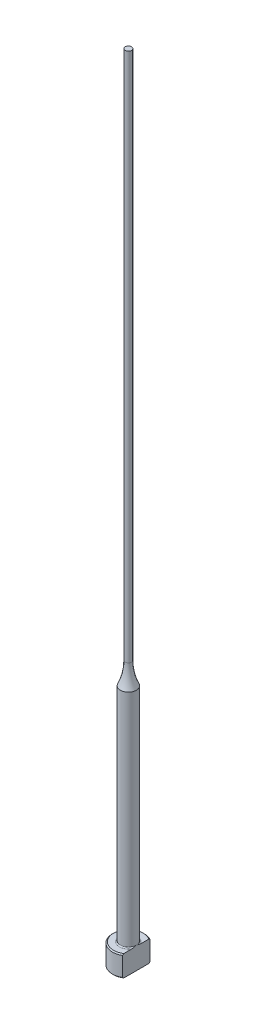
ISO-10303-21;
HEADER;
FILE_DESCRIPTION(('STEP AP214'),'2;1');
FILE_NAME('part.step','',(''),(''),'','','');
FILE_SCHEMA(('AUTOMOTIVE_DESIGN { 1 0 10303 214 1 1 1 1 }'));
ENDSEC;
DATA;
#1=APPLICATION_CONTEXT('core data for automotive mechanical design processes');
#2=APPLICATION_PROTOCOL_DEFINITION('international standard','automotive_design',2000,#1);
#3=PRODUCT_CONTEXT('',#1,'mechanical');
#4=PRODUCT('Part','Part','',(#3));
#5=PRODUCT_RELATED_PRODUCT_CATEGORY('part','',(#4));
#6=PRODUCT_DEFINITION_FORMATION('','',#4);
#7=PRODUCT_DEFINITION_CONTEXT('part definition',#1,'design');
#8=PRODUCT_DEFINITION('design','',#6,#7);
#9=PRODUCT_DEFINITION_SHAPE('','',#8);
#10=(LENGTH_UNIT() NAMED_UNIT(*) SI_UNIT(.MILLI.,.METRE.));
#11=(NAMED_UNIT(*) PLANE_ANGLE_UNIT() SI_UNIT($,.RADIAN.));
#12=(NAMED_UNIT(*) SI_UNIT($,.STERADIAN.) SOLID_ANGLE_UNIT());
#13=UNCERTAINTY_MEASURE_WITH_UNIT(LENGTH_MEASURE(1.E-05),#10,'distance_accuracy_value','');
#14=(GEOMETRIC_REPRESENTATION_CONTEXT(3) GLOBAL_UNCERTAINTY_ASSIGNED_CONTEXT((#13)) GLOBAL_UNIT_ASSIGNED_CONTEXT((#10,
#11,#12)) REPRESENTATION_CONTEXT('',''));
#15=CARTESIAN_POINT('',(0.,0.,0.));
#16=DIRECTION('',(0.,0.,1.));
#17=DIRECTION('',(1.,0.,0.));
#18=AXIS2_PLACEMENT_3D('',#15,#16,#17);
#19=CARTESIAN_POINT('',(-2.99999999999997,4.,0.));
#20=DIRECTION('',(0.,1.,0.));
#21=DIRECTION('',(0.,0.,1.));
#22=AXIS2_PLACEMENT_3D('',#19,#20,#21);
#23=PLANE('',#22);
#24=CARTESIAN_POINT('',(0.,4.,0.));
#25=DIRECTION('',(0.,1.,0.));
#26=DIRECTION('',(0.,0.,1.));
#27=AXIS2_PLACEMENT_3D('',#24,#25,#26);
#28=CIRCLE('',#27,2.79999999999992);
#29=CARTESIAN_POINT('',(1.49999999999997,4.,-2.3643180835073));
#30=VERTEX_POINT('',#29);
#31=CARTESIAN_POINT('',(1.49999999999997,4.,2.3643180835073));
#32=VERTEX_POINT('',#31);
#33=EDGE_CURVE('E187',#30,#32,#28,.T.);
#34=ORIENTED_EDGE('',*,*,#33,.T.);
#35=DIRECTION('',(0.,0.,-1.));
#36=VECTOR('',#35,1.);
#37=CARTESIAN_POINT('',(1.49999999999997,4.,0.));
#38=LINE('',#37,#36);
#39=CARTESIAN_POINT('',(1.49999999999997,3.99999999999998,0.799999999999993));
#40=VERTEX_POINT('',#39);
#41=EDGE_CURVE('E57',#32,#40,#38,.T.);
#42=ORIENTED_EDGE('',*,*,#41,.T.);
#43=CARTESIAN_POINT('',(0.,4.,0.));
#44=DIRECTION('',(0.,1.,0.));
#45=DIRECTION('',(0.,0.,1.));
#46=AXIS2_PLACEMENT_3D('',#43,#44,#45);
#47=CIRCLE('',#46,1.69999999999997);
#48=CARTESIAN_POINT('',(1.49999999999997,3.99999999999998,-0.799999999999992));
#49=VERTEX_POINT('',#48);
#50=EDGE_CURVE('E108',#40,#49,#47,.F.);
#51=ORIENTED_EDGE('',*,*,#50,.T.);
#52=EDGE_CURVE('E137',#49,#30,#38,.T.);
#53=ORIENTED_EDGE('',*,*,#52,.T.);
#54=EDGE_LOOP('',(#34,#42,#51,#53));
#55=FACE_BOUND('',#54,.T.);
#56=ADVANCED_FACE('F32',(#55),#23,.T.);
#57=CARTESIAN_POINT('',(0.,259.958771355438,0.));
#58=DIRECTION('',(0.,1.,0.));
#59=DIRECTION('',(0.,0.,1.));
#60=AXIS2_PLACEMENT_3D('',#57,#58,#59);
#61=CYLINDRICAL_SURFACE('',#60,2.99999999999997);
#62=CARTESIAN_POINT('',(0.,3.79999999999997,0.));
#63=DIRECTION('',(0.,1.,0.));
#64=DIRECTION('',(0.,0.,1.));
#65=AXIS2_PLACEMENT_3D('',#62,#63,#64);
#66=CIRCLE('',#65,2.99999999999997);
#67=CARTESIAN_POINT('',(1.49999999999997,3.79999999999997,2.5980762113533));
#68=VERTEX_POINT('',#67);
#69=CARTESIAN_POINT('',(1.49999999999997,3.79999999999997,-2.5980762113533));
#70=VERTEX_POINT('',#69);
#71=EDGE_CURVE('E105',#68,#70,#66,.F.);
#72=ORIENTED_EDGE('',*,*,#71,.T.);
#73=DIRECTION('',(0.,-1.,0.));
#74=VECTOR('',#73,1.);
#75=CARTESIAN_POINT('',(1.49999999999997,150.,-2.5980762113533));
#76=LINE('',#75,#74);
#77=CARTESIAN_POINT('',(1.49999999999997,0.199999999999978,-2.5980762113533));
#78=VERTEX_POINT('',#77);
#79=EDGE_CURVE('E193',#70,#78,#76,.T.);
#80=ORIENTED_EDGE('',*,*,#79,.T.);
#81=CARTESIAN_POINT('',(0.,0.199999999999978,0.));
#82=DIRECTION('',(0.,-1.,0.));
#83=DIRECTION('',(0.,0.,-1.));
#84=AXIS2_PLACEMENT_3D('',#81,#82,#83);
#85=CIRCLE('',#84,2.99999999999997);
#86=CARTESIAN_POINT('',(1.49999999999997,0.199999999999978,2.5980762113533));
#87=VERTEX_POINT('',#86);
#88=EDGE_CURVE('E100',#78,#87,#85,.F.);
#89=ORIENTED_EDGE('',*,*,#88,.T.);
#90=DIRECTION('',(0.,-1.,0.));
#91=VECTOR('',#90,1.);
#92=CARTESIAN_POINT('',(1.49999999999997,150.,2.5980762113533));
#93=LINE('',#92,#91);
#94=EDGE_CURVE('E93',#68,#87,#93,.T.);
#95=ORIENTED_EDGE('',*,*,#94,.F.);
#96=EDGE_LOOP('',(#72,#80,#89,#95));
#97=FACE_BOUND('',#96,.T.);
#98=ADVANCED_FACE('F158',(#97),#61,.T.);
#99=CARTESIAN_POINT('',(0.,0.,0.));
#100=DIRECTION('',(0.,-1.,0.));
#101=DIRECTION('',(0.,0.,-1.));
#102=AXIS2_PLACEMENT_3D('',#99,#100,#101);
#103=PLANE('',#102);
#104=CARTESIAN_POINT('',(0.,0.,0.));
#105=DIRECTION('',(0.,-1.,0.));
#106=DIRECTION('',(0.,0.,-1.));
#107=AXIS2_PLACEMENT_3D('',#104,#105,#106);
#108=CIRCLE('',#107,2.8);
#109=CARTESIAN_POINT('',(1.49999999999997,0.,2.36431808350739));
#110=VERTEX_POINT('',#109);
#111=CARTESIAN_POINT('',(1.49999999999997,0.,-2.36431808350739));
#112=VERTEX_POINT('',#111);
#113=EDGE_CURVE('E98',#110,#112,#108,.T.);
#114=ORIENTED_EDGE('',*,*,#113,.T.);
#115=DIRECTION('',(0.,0.,1.));
#116=VECTOR('',#115,1.);
#117=CARTESIAN_POINT('',(1.49999999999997,0.,2.5980762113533));
#118=LINE('',#117,#116);
#119=EDGE_CURVE('E83',#112,#110,#118,.T.);
#120=ORIENTED_EDGE('',*,*,#119,.T.);
#121=EDGE_LOOP('',(#114,#120));
#122=FACE_BOUND('',#121,.T.);
#123=ADVANCED_FACE('F103',(#122),#103,.T.);
#124=CARTESIAN_POINT('',(0.,4.,0.));
#125=DIRECTION('',(0.,-1.,0.));
#126=DIRECTION('',(0.,0.,-1.));
#127=AXIS2_PLACEMENT_3D('',#124,#125,#126);
#128=CONICAL_SURFACE('',#127,2.79999999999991,0.7853981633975);
#129=ORIENTED_EDGE('',*,*,#71,.F.);
#130=CARTESIAN_POINT('',(1.49999999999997,0.888258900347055,5.71827621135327));
#131=CARTESIAN_POINT('',(1.49999999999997,1.01361833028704,5.58866816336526));
#132=CARTESIAN_POINT('',(1.49999999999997,1.13884324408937,5.45892957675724));
#133=CARTESIAN_POINT('',(1.49999999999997,1.38894444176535,5.19911365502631));
#134=CARTESIAN_POINT('',(1.49999999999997,1.51382072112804,5.06903631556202));
#135=CARTESIAN_POINT('',(1.49999999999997,1.76320568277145,4.8084018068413));
#136=CARTESIAN_POINT('',(1.49999999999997,1.88771414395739,4.67784442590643));
#137=CARTESIAN_POINT('',(1.49999999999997,2.13618059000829,4.41620813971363));
#138=CARTESIAN_POINT('',(1.49999999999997,2.26013857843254,4.28512923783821));
#139=CARTESIAN_POINT('',(1.49999999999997,2.50488975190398,4.02490837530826));
#140=CARTESIAN_POINT('',(1.49999999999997,2.62569693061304,3.89577958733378));
#141=CARTESIAN_POINT('',(1.49999999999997,2.86640694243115,3.63668213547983));
#142=CARTESIAN_POINT('',(1.49999999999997,2.98630978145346,3.5067134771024));
#143=CARTESIAN_POINT('',(1.49999999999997,3.22486033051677,3.24567921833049));
#144=CARTESIAN_POINT('',(1.49999999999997,3.34350830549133,3.11461386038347));
#145=CARTESIAN_POINT('',(1.49999999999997,3.57907716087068,2.85094268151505));
#146=CARTESIAN_POINT('',(1.49999999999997,3.69599811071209,2.71833692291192));
#147=CARTESIAN_POINT('',(1.49999999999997,3.88262371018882,2.50255231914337));
#148=CARTESIAN_POINT('',(1.49999999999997,3.95312454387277,2.42006293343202));
#149=CARTESIAN_POINT('',(1.49999999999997,4.09287098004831,2.25401084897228));
#150=CARTESIAN_POINT('',(1.49999999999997,4.16211645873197,2.17044804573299));
#151=CARTESIAN_POINT('',(1.49999999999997,4.29964684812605,2.00105967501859));
#152=CARTESIAN_POINT('',(1.49999999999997,4.36791386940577,1.91521952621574));
#153=CARTESIAN_POINT('',(1.49999999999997,4.50205840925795,1.74171392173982));
#154=CARTESIAN_POINT('',(1.49999999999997,4.56793649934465,1.65404891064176));
#155=CARTESIAN_POINT('',(1.49999999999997,4.69728151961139,1.47490236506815));
#156=CARTESIAN_POINT('',(1.49999999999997,4.76069661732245,1.38338308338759));
#157=CARTESIAN_POINT('',(1.49999999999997,4.88239539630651,1.1967566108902));
#158=CARTESIAN_POINT('',(1.49999999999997,4.9406720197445,1.10164473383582));
#159=CARTESIAN_POINT('',(1.49999999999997,5.04841325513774,0.908008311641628));
#160=CARTESIAN_POINT('',(1.49999999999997,5.09797809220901,0.809540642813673));
#161=CARTESIAN_POINT('',(1.49999999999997,5.18432188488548,0.607192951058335));
#162=CARTESIAN_POINT('',(1.49999999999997,5.22114374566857,0.503332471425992));
#163=CARTESIAN_POINT('',(1.49999999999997,5.26099935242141,0.347577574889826));
#164=CARTESIAN_POINT('',(1.49999999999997,5.27157029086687,0.297609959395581));
#165=CARTESIAN_POINT('',(1.49999999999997,5.28794860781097,0.196885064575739));
#166=CARTESIAN_POINT('',(1.49999999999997,5.29375640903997,0.146127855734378));
#167=CARTESIAN_POINT('',(1.49999999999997,5.3001970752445,0.0444388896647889));
#168=CARTESIAN_POINT('',(1.49999999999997,5.3008459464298,-0.00649183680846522));
#169=CARTESIAN_POINT('',(1.49999999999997,5.29696416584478,-0.108155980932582));
#170=CARTESIAN_POINT('',(1.49999999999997,5.29243308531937,-0.158889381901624));
#171=CARTESIAN_POINT('',(1.49999999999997,5.2785691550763,-0.259234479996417));
#172=CARTESIAN_POINT('',(1.49999999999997,5.2692782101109,-0.308852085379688));
#173=CARTESIAN_POINT('',(1.49999999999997,5.24647108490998,-0.40711049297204));
#174=CARTESIAN_POINT('',(1.49999999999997,5.23295324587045,-0.455750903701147));
#175=CARTESIAN_POINT('',(1.49999999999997,5.20226175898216,-0.552149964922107));
#176=CARTESIAN_POINT('',(1.49999999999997,5.18506801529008,-0.5999021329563));
#177=CARTESIAN_POINT('',(1.49999999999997,5.14771387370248,-0.694205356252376));
#178=CARTESIAN_POINT('',(1.49999999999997,5.12755408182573,-0.740756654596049));
#179=CARTESIAN_POINT('',(1.49999999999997,5.06327696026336,-0.879166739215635));
#180=CARTESIAN_POINT('',(1.49999999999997,5.01551721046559,-0.969329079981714));
#181=CARTESIAN_POINT('',(1.49999999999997,4.91367909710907,-1.1460431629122));
#182=CARTESIAN_POINT('',(1.49999999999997,4.85959300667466,-1.23259031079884));
#183=CARTESIAN_POINT('',(1.49999999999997,4.74697968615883,-1.40321348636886));
#184=CARTESIAN_POINT('',(1.49999999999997,4.68843573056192,-1.48727838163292));
#185=CARTESIAN_POINT('',(1.49999999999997,4.56843845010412,-1.6532218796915));
#186=CARTESIAN_POINT('',(1.49999999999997,4.50698656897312,-1.73510153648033));
#187=CARTESIAN_POINT('',(1.49999999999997,4.38115673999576,-1.89829823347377));
#188=CARTESIAN_POINT('',(1.49999999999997,4.31675092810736,-1.9795936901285));
#189=CARTESIAN_POINT('',(1.49999999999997,4.18634068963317,-2.14090082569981));
#190=CARTESIAN_POINT('',(1.49999999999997,4.12033609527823,-2.22091236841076));
#191=CARTESIAN_POINT('',(1.49999999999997,3.92086431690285,-2.45906508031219));
#192=CARTESIAN_POINT('',(1.49999999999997,3.78562663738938,-2.61572090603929));
#193=CARTESIAN_POINT('',(1.49999999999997,3.53554498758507,-2.90006295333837));
#194=CARTESIAN_POINT('',(1.49999999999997,3.42114543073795,-3.02814382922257));
#195=CARTESIAN_POINT('',(1.49999999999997,3.19093557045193,-3.28303767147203));
#196=CARTESIAN_POINT('',(1.49999999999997,3.07512522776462,-3.40985060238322));
#197=CARTESIAN_POINT('',(1.49999999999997,2.72597067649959,-3.78913849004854));
#198=CARTESIAN_POINT('',(1.49999999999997,2.49111760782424,-4.04022177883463));
#199=CARTESIAN_POINT('',(1.49999999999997,2.02882478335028,-4.52992803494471));
#200=CARTESIAN_POINT('',(1.49999999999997,1.80147747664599,-4.76863870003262));
#201=CARTESIAN_POINT('',(1.49999999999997,1.45954865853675,-5.12558036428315));
#202=CARTESIAN_POINT('',(1.49999999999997,1.34548484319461,-5.24430773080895));
#203=CARTESIAN_POINT('',(1.49999999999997,1.11707176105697,-5.48148573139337));
#204=CARTESIAN_POINT('',(1.49999999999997,1.00272249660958,-5.59993636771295));
#205=CARTESIAN_POINT('',(1.49999999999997,0.888258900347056,-5.71827621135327));
#206=B_SPLINE_CURVE_WITH_KNOTS('',3,(#130,#131,#132,#133,#134,#135,#136,#137,#138,#139,#140,
#141,#142,#143,#144,#145,#146,#147,#148,#149,#150,#151,#152,#153,#154,#155,#156,#157,#158,#159,
#160,#161,#162,#163,#164,#165,#166,#167,#168,#169,#170,#171,#172,#173,#174,#175,#176,#177,#178,
#179,#180,#181,#182,#183,#184,#185,#186,#187,#188,#189,#190,#191,#192,#193,#194,#195,#196,#197,
#198,#199,#200,#201,#202,#203,#204,#205),.UNSPECIFIED.,.F.,.F.,(4,2,2,2,2,2,2,2,2,2,2,2,2,2,2,2,
2,2,2,2,2,2,2,2,2,2,2,2,2,2,2,2,2,2,2,2,2,4),(0.,0.540943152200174,1.08189327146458,
1.62312052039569,2.16434426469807,2.69482920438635,3.22531067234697,3.75567781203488,
4.28602356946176,4.61155053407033,4.93710943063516,5.26610945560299,5.59503024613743,
5.92894782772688,6.26331713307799,6.59354403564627,6.92264800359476,7.07567478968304,
7.22868799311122,7.38122626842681,7.53377717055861,7.68500755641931,7.83629736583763,
7.98843643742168,8.14054446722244,8.4461879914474,8.75220879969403,9.05944044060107,
9.366521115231,9.677642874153,9.98879742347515,10.6095925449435,11.1247803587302,
11.6399825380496,12.6713544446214,13.6603005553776,14.1542238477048,14.648143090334),.UNSPECIFIED.);
#207=EDGE_CURVE('E136',#68,#32,#206,.T.);
#208=ORIENTED_EDGE('',*,*,#207,.T.);
#209=ORIENTED_EDGE('',*,*,#33,.F.);
#210=EDGE_CURVE('E128',#30,#70,#206,.T.);
#211=ORIENTED_EDGE('',*,*,#210,.T.);
#212=EDGE_LOOP('',(#129,#208,#209,#211));
#213=FACE_BOUND('',#212,.T.);
#214=ADVANCED_FACE('F144',(#213),#128,.T.);
#215=CARTESIAN_POINT('',(0.,0.199999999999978,0.));
#216=DIRECTION('',(0.,1.,0.));
#217=DIRECTION('',(0.,0.,1.));
#218=AXIS2_PLACEMENT_3D('',#215,#216,#217);
#219=CONICAL_SURFACE('',#218,2.99999999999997,0.785398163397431);
#220=ORIENTED_EDGE('',*,*,#88,.F.);
#221=CARTESIAN_POINT('',(1.49999999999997,3.1117410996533,-5.71827621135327));
#222=CARTESIAN_POINT('',(1.49999999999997,2.98638166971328,-5.58866816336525));
#223=CARTESIAN_POINT('',(1.49999999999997,2.86115675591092,-5.45892957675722));
#224=CARTESIAN_POINT('',(1.49999999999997,2.61105555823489,-5.19911365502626));
#225=CARTESIAN_POINT('',(1.49999999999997,2.48617927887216,-5.06903631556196));
#226=CARTESIAN_POINT('',(1.49999999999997,2.23679431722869,-4.80840180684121));
#227=CARTESIAN_POINT('',(1.49999999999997,2.11228585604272,-4.67784442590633));
#228=CARTESIAN_POINT('',(1.49999999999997,1.86381940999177,-4.4162081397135));
#229=CARTESIAN_POINT('',(1.49999999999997,1.73986142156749,-4.28512923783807));
#230=CARTESIAN_POINT('',(1.49999999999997,1.49511024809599,-4.02490837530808));
#231=CARTESIAN_POINT('',(1.49999999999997,1.3743030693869,-3.8957795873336));
#232=CARTESIAN_POINT('',(1.49999999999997,1.13359305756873,-3.63668213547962));
#233=CARTESIAN_POINT('',(1.49999999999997,1.0136902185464,-3.50671347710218));
#234=CARTESIAN_POINT('',(1.49999999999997,0.77513966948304,-3.24567921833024));
#235=CARTESIAN_POINT('',(1.49999999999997,0.656491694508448,-3.11461386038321));
#236=CARTESIAN_POINT('',(1.49999999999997,0.420922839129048,-2.85094268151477));
#237=CARTESIAN_POINT('',(1.49999999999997,0.30400188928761,-2.71833692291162));
#238=CARTESIAN_POINT('',(1.49999999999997,0.11737628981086,-2.50255231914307));
#239=CARTESIAN_POINT('',(1.49999999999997,0.046875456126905,-2.42006293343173));
#240=CARTESIAN_POINT('',(1.49999999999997,-0.0928709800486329,-2.254010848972));
#241=CARTESIAN_POINT('',(1.49999999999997,-0.162116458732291,-2.17044804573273));
#242=CARTESIAN_POINT('',(1.49999999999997,-0.299646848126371,-2.00105967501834));
#243=CARTESIAN_POINT('',(1.49999999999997,-0.367913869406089,-1.9152195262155));
#244=CARTESIAN_POINT('',(1.49999999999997,-0.502058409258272,-1.7417139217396));
#245=CARTESIAN_POINT('',(1.49999999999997,-0.567936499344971,-1.65404891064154));
#246=CARTESIAN_POINT('',(1.49999999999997,-0.697281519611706,-1.47490236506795));
#247=CARTESIAN_POINT('',(1.49999999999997,-0.76069661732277,-1.38338308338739));
#248=CARTESIAN_POINT('',(1.49999999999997,-0.882395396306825,-1.19675661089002));
#249=CARTESIAN_POINT('',(1.49999999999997,-0.940672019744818,-1.10164473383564));
#250=CARTESIAN_POINT('',(1.49999999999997,-1.04841325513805,-0.908008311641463));
#251=CARTESIAN_POINT('',(1.49999999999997,-1.09797809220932,-0.809540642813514));
#252=CARTESIAN_POINT('',(1.49999999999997,-1.18432188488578,-0.607192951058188));
#253=CARTESIAN_POINT('',(1.49999999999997,-1.22114374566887,-0.50333247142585));
#254=CARTESIAN_POINT('',(1.49999999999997,-1.26099935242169,-0.347577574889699));
#255=CARTESIAN_POINT('',(1.49999999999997,-1.27157029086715,-0.297609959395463));
#256=CARTESIAN_POINT('',(1.49999999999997,-1.28794860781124,-0.196885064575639));
#257=CARTESIAN_POINT('',(1.49999999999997,-1.29375640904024,-0.146127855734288));
#258=CARTESIAN_POINT('',(1.49999999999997,-1.30019707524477,-0.0444388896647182));
#259=CARTESIAN_POINT('',(1.49999999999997,-1.30084594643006,0.00649183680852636));
#260=CARTESIAN_POINT('',(1.49999999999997,-1.29696416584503,0.108155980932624));
#261=CARTESIAN_POINT('',(1.49999999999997,-1.29243308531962,0.158889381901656));
#262=CARTESIAN_POINT('',(1.49999999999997,-1.27856915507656,0.25923447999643));
#263=CARTESIAN_POINT('',(1.49999999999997,-1.26927821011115,0.308852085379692));
#264=CARTESIAN_POINT('',(1.49999999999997,-1.24647108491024,0.407110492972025));
#265=CARTESIAN_POINT('',(1.49999999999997,-1.2329532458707,0.455750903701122));
#266=CARTESIAN_POINT('',(1.49999999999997,-1.20226175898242,0.552149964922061));
#267=CARTESIAN_POINT('',(1.49999999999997,-1.18506801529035,0.599902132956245));
#268=CARTESIAN_POINT('',(1.49999999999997,-1.14771387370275,0.694205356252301));
#269=CARTESIAN_POINT('',(1.49999999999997,-1.12755408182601,0.740756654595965));
#270=CARTESIAN_POINT('',(1.49999999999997,-1.06327696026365,0.879166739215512));
#271=CARTESIAN_POINT('',(1.49999999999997,-1.0155172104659,0.969329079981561));
#272=CARTESIAN_POINT('',(1.49999999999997,-0.913679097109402,1.14604316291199));
#273=CARTESIAN_POINT('',(1.49999999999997,-0.859593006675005,1.2325903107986));
#274=CARTESIAN_POINT('',(1.49999999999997,-0.746979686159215,1.40321348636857));
#275=CARTESIAN_POINT('',(1.49999999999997,-0.688435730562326,1.4872783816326));
#276=CARTESIAN_POINT('',(1.49999999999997,-0.568438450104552,1.65322187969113));
#277=CARTESIAN_POINT('',(1.49999999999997,-0.506986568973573,1.73510153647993));
#278=CARTESIAN_POINT('',(1.49999999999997,-0.381156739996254,1.89829823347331));
#279=CARTESIAN_POINT('',(1.49999999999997,-0.316750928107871,1.97959369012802));
#280=CARTESIAN_POINT('',(1.49999999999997,-0.18634068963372,2.14090082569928));
#281=CARTESIAN_POINT('',(1.49999999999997,-0.120336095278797,2.22091236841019));
#282=CARTESIAN_POINT('',(1.49999999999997,0.0791356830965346,2.45906508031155));
#283=CARTESIAN_POINT('',(1.49999999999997,0.214373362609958,2.61572090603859));
#284=CARTESIAN_POINT('',(1.49999999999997,0.464455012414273,2.90006295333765));
#285=CARTESIAN_POINT('',(1.49999999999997,0.578854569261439,3.02814382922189));
#286=CARTESIAN_POINT('',(1.49999999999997,0.809064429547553,3.28303767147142));
#287=CARTESIAN_POINT('',(1.49999999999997,0.924874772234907,3.40985060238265));
#288=CARTESIAN_POINT('',(1.49999999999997,1.27402932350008,3.78913849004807));
#289=CARTESIAN_POINT('',(1.49999999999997,1.50888239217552,4.04022177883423));
#290=CARTESIAN_POINT('',(1.49999999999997,1.97117521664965,4.52992803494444));
#291=CARTESIAN_POINT('',(1.49999999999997,2.19852252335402,4.76863870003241));
#292=CARTESIAN_POINT('',(1.49999999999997,2.54045134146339,5.12558036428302));
#293=CARTESIAN_POINT('',(1.49999999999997,2.65451515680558,5.24430773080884));
#294=CARTESIAN_POINT('',(1.49999999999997,2.8829282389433,5.48148573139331));
#295=CARTESIAN_POINT('',(1.49999999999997,2.99727750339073,5.59993636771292));
#296=CARTESIAN_POINT('',(1.49999999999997,3.1117410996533,5.71827621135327));
#297=B_SPLINE_CURVE_WITH_KNOTS('',3,(#221,#222,#223,#224,#225,#226,#227,#228,#229,#230,#231,
#232,#233,#234,#235,#236,#237,#238,#239,#240,#241,#242,#243,#244,#245,#246,#247,#248,#249,#250,
#251,#252,#253,#254,#255,#256,#257,#258,#259,#260,#261,#262,#263,#264,#265,#266,#267,#268,#269,
#270,#271,#272,#273,#274,#275,#276,#277,#278,#279,#280,#281,#282,#283,#284,#285,#286,#287,#288,
#289,#290,#291,#292,#293,#294,#295,#296),.UNSPECIFIED.,.F.,.F.,(4,2,2,2,2,2,2,2,2,2,2,2,2,2,2,2,
2,2,2,2,2,2,2,2,2,2,2,2,2,2,2,2,2,2,2,2,2,4),(0.,0.540943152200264,1.08189327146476,
1.62312052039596,2.16434426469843,2.69482920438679,3.22531067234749,3.75567781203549,
4.28602356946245,4.611550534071,4.9371094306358,5.26610945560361,5.59503024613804,
5.92894782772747,6.26331713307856,6.59354403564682,6.92264800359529,7.07567478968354,
7.22868799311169,7.38122626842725,7.53377717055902,7.6850075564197,7.83629736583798,
7.98843643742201,8.14054446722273,8.44618799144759,8.75220879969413,9.05944044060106,
9.3665211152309,9.6776428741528,9.98879742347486,10.609592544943,11.1247803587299,
11.6399825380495,12.6713544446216,13.6603005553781,14.1542238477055,14.6481430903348),.UNSPECIFIED.);
#298=EDGE_CURVE('E86',#78,#112,#297,.T.);
#299=ORIENTED_EDGE('',*,*,#298,.T.);
#300=ORIENTED_EDGE('',*,*,#113,.F.);
#301=EDGE_CURVE('E89',#110,#87,#297,.T.);
#302=ORIENTED_EDGE('',*,*,#301,.T.);
#303=EDGE_LOOP('',(#220,#299,#300,#302));
#304=FACE_BOUND('',#303,.T.);
#305=ADVANCED_FACE('F97',(#304),#219,.T.);
#306=CARTESIAN_POINT('',(0.,4.19999999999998,0.));
#307=DIRECTION('',(0.,1.,0.));
#308=DIRECTION('',(0.,0.,1.));
#309=AXIS2_PLACEMENT_3D('',#306,#307,#308);
#310=TOROIDAL_SURFACE('',#309,1.69999999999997,0.2);
#311=CARTESIAN_POINT('',(1.49999999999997,4.19999999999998,0.));
#312=CARTESIAN_POINT('',(1.49999999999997,4.20000050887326,7.14686674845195E-11));
#313=CARTESIAN_POINT('',(1.49999999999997,4.20000101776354,-1.21663673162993E-07));
#314=CARTESIAN_POINT('',(1.49999999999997,4.20000199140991,-4.97616237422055E-07));
#315=CARTESIAN_POINT('',(1.49999999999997,4.20000245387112,-7.56516220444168E-07));
#316=CARTESIAN_POINT('',(1.49999999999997,4.20000338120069,-1.37642837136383E-06));
#317=CARTESIAN_POINT('',(1.49999999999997,4.20000384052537,-1.74563476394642E-06));
#318=CARTESIAN_POINT('',(1.49999999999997,4.20000469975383,-2.53565984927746E-06));
#319=CARTESIAN_POINT('',(1.49999999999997,4.20000510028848,-2.95582597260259E-06));
#320=CARTESIAN_POINT('',(1.49999999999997,4.20000646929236,-4.48430445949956E-06));
#321=CARTESIAN_POINT('',(1.49999999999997,4.20000736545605,-5.6586103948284E-06));
#322=CARTESIAN_POINT('',(1.49999999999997,4.20000893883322,-8.06479202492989E-06));
#323=CARTESIAN_POINT('',(1.49999999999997,4.20000962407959,-9.29170517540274E-06));
#324=CARTESIAN_POINT('',(1.49999999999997,4.20001225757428,-1.416232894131E-05));
#325=CARTESIAN_POINT('',(1.49999999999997,4.20001407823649,-1.78790031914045E-05));
#326=CARTESIAN_POINT('',(1.49999999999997,4.20001699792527,-2.51443066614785E-05));
#327=CARTESIAN_POINT('',(1.49999999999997,4.20001815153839,-2.86715394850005E-05));
#328=CARTESIAN_POINT('',(1.49999999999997,4.20002315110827,-4.39218128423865E-05));
#329=CARTESIAN_POINT('',(1.49999999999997,4.20002701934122,-5.56288390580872E-05));
#330=CARTESIAN_POINT('',(1.49999999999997,4.20003312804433,-7.7405829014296E-05));
#331=CARTESIAN_POINT('',(1.49999999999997,4.20003553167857,-8.74278412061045E-05));
#332=CARTESIAN_POINT('',(1.49999999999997,4.20005483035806,-0.000161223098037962));
#333=CARTESIAN_POINT('',(1.49999999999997,4.20007979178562,-0.000222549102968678));
#334=CARTESIAN_POINT('',(1.49999999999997,4.20017391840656,-0.000462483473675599));
#335=CARTESIAN_POINT('',(1.49999999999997,4.20023706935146,-0.000642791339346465));
#336=CARTESIAN_POINT('',(1.49999999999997,4.20048761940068,-0.00134785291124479));
#337=CARTESIAN_POINT('',(1.49999999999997,4.20068132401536,-0.00187087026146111));
#338=CARTESIAN_POINT('',(1.49999999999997,4.20147357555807,-0.00402004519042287));
#339=CARTESIAN_POINT('',(1.49999999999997,4.20206499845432,-0.0056481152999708));
#340=CARTESIAN_POINT('',(1.49999999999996,4.20892634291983,-0.0245232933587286));
#341=CARTESIAN_POINT('',(1.49999999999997,4.21523683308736,-0.041759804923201));
#342=CARTESIAN_POINT('',(1.49999999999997,4.22755028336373,-0.0756091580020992));
#343=CARTESIAN_POINT('',(1.49999999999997,4.23355589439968,-0.0922211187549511));
#344=CARTESIAN_POINT('',(1.49999999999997,4.24620101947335,-0.127454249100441));
#345=CARTESIAN_POINT('',(1.49999999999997,4.25283080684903,-0.146078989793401));
#346=CARTESIAN_POINT('',(1.49999999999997,4.26599765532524,-0.183577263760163));
#347=CARTESIAN_POINT('',(1.49999999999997,4.27253305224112,-0.202451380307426));
#348=CARTESIAN_POINT('',(1.49999999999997,4.28834228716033,-0.248982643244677));
#349=CARTESIAN_POINT('',(1.49999999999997,4.2974915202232,-0.276682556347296));
#350=CARTESIAN_POINT('',(1.49999999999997,4.31490935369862,-0.331625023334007));
#351=CARTESIAN_POINT('',(1.49999999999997,4.3231938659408,-0.358862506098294));
#352=CARTESIAN_POINT('',(1.49999999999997,4.34051594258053,-0.419125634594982));
#353=CARTESIAN_POINT('',(1.49999999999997,4.34936607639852,-0.452206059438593));
#354=CARTESIAN_POINT('',(1.49999999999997,4.36549583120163,-0.519023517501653));
#355=CARTESIAN_POINT('',(1.49999999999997,4.37276283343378,-0.552763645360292));
#356=CARTESIAN_POINT('',(1.49999999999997,4.38554755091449,-0.62305310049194));
#357=CARTESIAN_POINT('',(1.49999999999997,4.39090573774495,-0.65963271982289));
#358=CARTESIAN_POINT('',(1.49999999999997,4.39825016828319,-0.733028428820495));
#359=CARTESIAN_POINT('',(1.49999999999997,4.40024734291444,-0.76984335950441));
#360=CARTESIAN_POINT('',(1.49999999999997,4.39970780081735,-0.842856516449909));
#361=CARTESIAN_POINT('',(1.49999999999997,4.39725347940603,-0.879053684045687));
#362=CARTESIAN_POINT('',(1.49999999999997,4.38900085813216,-0.93238076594));
#363=CARTESIAN_POINT('',(1.49999999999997,4.38553049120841,-0.949868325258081));
#364=CARTESIAN_POINT('',(1.49999999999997,4.37678336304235,-0.984374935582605));
#365=CARTESIAN_POINT('',(1.49999999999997,4.37150943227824,-1.00139467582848));
#366=CARTESIAN_POINT('',(1.49999999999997,4.35869781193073,-1.03479423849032));
#367=CARTESIAN_POINT('',(1.49999999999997,4.3511359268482,-1.05116499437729));
#368=CARTESIAN_POINT('',(1.49999999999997,4.33325333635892,-1.08234828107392));
#369=CARTESIAN_POINT('',(1.49999999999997,4.32294266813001,-1.09716621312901));
#370=CARTESIAN_POINT('',(1.49999999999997,4.30512758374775,-1.11714173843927));
#371=CARTESIAN_POINT('',(1.49999999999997,4.29884721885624,-1.12339066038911));
#372=CARTESIAN_POINT('',(1.49999999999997,4.28545950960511,-1.13494695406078));
#373=CARTESIAN_POINT('',(1.49999999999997,4.27835226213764,-1.14025443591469));
#374=CARTESIAN_POINT('',(1.49999999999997,4.26325970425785,-1.14967631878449));
#375=CARTESIAN_POINT('',(1.49999999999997,4.25526534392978,-1.15377649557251));
#376=CARTESIAN_POINT('',(1.49999999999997,4.23863207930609,-1.16034952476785));
#377=CARTESIAN_POINT('',(1.49999999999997,4.22999427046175,-1.16282507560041));
#378=CARTESIAN_POINT('',(1.49999999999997,4.21343922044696,-1.16570267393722));
#379=CARTESIAN_POINT('',(1.49999999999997,4.20555896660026,-1.16631687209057));
#380=CARTESIAN_POINT('',(1.49999999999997,4.18982775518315,-1.16602054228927));
#381=CARTESIAN_POINT('',(1.49999999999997,4.18197679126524,-1.16511036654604));
#382=CARTESIAN_POINT('',(1.49999999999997,4.16747846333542,-1.16204446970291));
#383=CARTESIAN_POINT('',(1.49999999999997,4.16079696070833,-1.16004509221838));
#384=CARTESIAN_POINT('',(1.49999999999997,4.14781700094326,-1.15505972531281));
#385=CARTESIAN_POINT('',(1.49999999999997,4.14151862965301,-1.1520735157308));
#386=CARTESIAN_POINT('',(1.49999999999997,4.12690214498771,-1.14387585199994));
#387=CARTESIAN_POINT('',(1.49999999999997,4.11881436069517,-1.13825400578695));
#388=CARTESIAN_POINT('',(1.49999999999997,4.1036444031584,-1.12578441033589));
#389=CARTESIAN_POINT('',(1.49999999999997,4.09656475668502,-1.11893367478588));
#390=CARTESIAN_POINT('',(1.49999999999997,4.08012297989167,-1.10074342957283));
#391=CARTESIAN_POINT('',(1.49999999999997,4.07136543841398,-1.08886044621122));
#392=CARTESIAN_POINT('',(1.49999999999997,4.05578194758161,-1.06392743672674));
#393=CARTESIAN_POINT('',(1.49999999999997,4.0489571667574,-1.05087671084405));
#394=CARTESIAN_POINT('',(1.49999999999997,4.03273856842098,-1.01472307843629));
#395=CARTESIAN_POINT('',(1.49999999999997,4.02486230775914,-0.990945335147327));
#396=CARTESIAN_POINT('',(1.49999999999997,4.01257693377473,-0.94232199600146));
#397=CARTESIAN_POINT('',(1.49999999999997,4.00820590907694,-0.917467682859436));
#398=CARTESIAN_POINT('',(1.49999999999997,4.00229956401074,-0.867912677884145));
#399=CARTESIAN_POINT('',(1.49999999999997,4.0007128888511,-0.843217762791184));
#400=CARTESIAN_POINT('',(1.49999999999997,3.9996723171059,-0.79374605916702));
#401=CARTESIAN_POINT('',(1.49999999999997,4.0002230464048,-0.768969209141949));
#402=CARTESIAN_POINT('',(1.49999999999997,4.00433101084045,-0.696994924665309));
#403=CARTESIAN_POINT('',(1.49999999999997,4.01016976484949,-0.64993124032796));
#404=CARTESIAN_POINT('',(1.49999999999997,4.02567776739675,-0.559166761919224));
#405=CARTESIAN_POINT('',(1.49999999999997,4.03511950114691,-0.515423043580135));
#406=CARTESIAN_POINT('',(1.49999999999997,4.05693059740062,-0.427590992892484));
#407=CARTESIAN_POINT('',(1.49999999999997,4.06936356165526,-0.383518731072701));
#408=CARTESIAN_POINT('',(1.49999999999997,4.09174953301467,-0.310161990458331));
#409=CARTESIAN_POINT('',(1.49999999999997,4.10119843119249,-0.280718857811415));
#410=CARTESIAN_POINT('',(1.49999999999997,4.12060442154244,-0.22234098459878));
#411=CARTESIAN_POINT('',(1.49999999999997,4.13055519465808,-0.193404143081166));
#412=CARTESIAN_POINT('',(1.49999999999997,4.14973721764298,-0.138756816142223));
#413=CARTESIAN_POINT('',(1.49999999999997,4.15893123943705,-0.113033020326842));
#414=CARTESIAN_POINT('',(1.49999999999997,4.17788037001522,-0.0606351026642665));
#415=CARTESIAN_POINT('',(1.49999999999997,4.18764328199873,-0.0339636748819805));
#416=CARTESIAN_POINT('',(1.49999999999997,4.19793548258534,-0.00564657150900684));
#417=CARTESIAN_POINT('',(1.49999999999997,4.19852751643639,-0.00401699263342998));
#418=CARTESIAN_POINT('',(1.49999999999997,4.1993199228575,-0.0018674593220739));
#419=CARTESIAN_POINT('',(1.49999999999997,4.19951319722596,-0.00134559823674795));
#420=CARTESIAN_POINT('',(1.49999999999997,4.19976322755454,-0.000641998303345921));
#421=CARTESIAN_POINT('',(1.49999999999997,4.19982627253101,-0.000461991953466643));
#422=CARTESIAN_POINT('',(1.49999999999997,4.19992025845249,-0.000222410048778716));
#423=CARTESIAN_POINT('',(1.49999999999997,4.19994519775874,-0.000161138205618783));
#424=CARTESIAN_POINT('',(1.49999999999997,4.19996448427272,-8.74039267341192E-05));
#425=CARTESIAN_POINT('',(1.49999999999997,4.19996688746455,-7.73857556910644E-05));
#426=CARTESIAN_POINT('',(1.49999999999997,4.1999729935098,-5.56173272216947E-05));
#427=CARTESIAN_POINT('',(1.49999999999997,4.19997685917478,-4.39149186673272E-05));
#428=CARTESIAN_POINT('',(1.49999999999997,4.19998185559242,-2.86698156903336E-05));
#429=CARTESIAN_POINT('',(1.49999999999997,4.19998300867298,-2.51431575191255E-05));
#430=CARTESIAN_POINT('',(1.49999999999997,4.19998592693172,-1.78789552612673E-05));
#431=CARTESIAN_POINT('',(1.49999999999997,4.19998774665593,-1.41627846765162E-05));
#432=CARTESIAN_POINT('',(1.49999999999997,4.19999037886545,-9.29264488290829E-06));
#433=CARTESIAN_POINT('',(1.49999999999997,4.19999106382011,-8.06577599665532E-06));
#434=CARTESIAN_POINT('',(1.49999999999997,4.19999263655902,-5.65962639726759E-06));
#435=CARTESIAN_POINT('',(1.49999999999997,4.19999353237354,-4.48530466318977E-06));
#436=CARTESIAN_POINT('',(1.49999999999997,4.19999490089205,-2.95673740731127E-06));
#437=CARTESIAN_POINT('',(1.49999999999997,4.1999953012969,-2.53653208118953E-06));
#438=CARTESIAN_POINT('',(1.49999999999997,4.19999616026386,-1.74640525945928E-06));
#439=CARTESIAN_POINT('',(1.49999999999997,4.19999661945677,-1.37713598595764E-06));
#440=CARTESIAN_POINT('',(1.49999999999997,4.19999754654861,-7.57072336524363E-07));
#441=CARTESIAN_POINT('',(1.49999999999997,4.19999800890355,-4.9808738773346E-07));
#442=CARTESIAN_POINT('',(1.49999999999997,4.19999898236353,-1.21927249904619E-07));
#443=CARTESIAN_POINT('',(1.49999999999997,4.19999949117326,-7.14621294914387E-11));
#444=CARTESIAN_POINT('',(1.49999999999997,4.19999999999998,0.));
#445=B_SPLINE_CURVE_WITH_KNOTS('',3,(#311,#312,#313,#314,#315,#316,#317,#318,#319,#320,#321,
#322,#323,#324,#325,#326,#327,#328,#329,#330,#331,#332,#333,#334,#335,#336,#337,#338,#339,#340,
#341,#342,#343,#344,#345,#346,#347,#348,#349,#350,#351,#352,#353,#354,#355,#356,#357,#358,#359,
#360,#361,#362,#363,#364,#365,#366,#367,#368,#369,#370,#371,#372,#373,#374,#375,#376,#377,#378,
#379,#380,#381,#382,#383,#384,#385,#386,#387,#388,#389,#390,#391,#392,#393,#394,#395,#396,#397,
#398,#399,#400,#401,#402,#403,#404,#405,#406,#407,#408,#409,#410,#411,#412,#413,#414,#415,#416,
#417,#418,#419,#420,#421,#422,#423,#424,#425,#426,#427,#428,#429,#430,#431,#432,#433,#434,#435,
#436,#437,#438,#439,#440,#441,#442,#443,#444),.UNSPECIFIED.,.T.,.F.,(4,2,2,2,2,2,2,2,2,2,2,2,2,
2,2,2,2,2,2,2,2,2,2,2,2,2,2,2,2,2,2,2,2,2,2,2,2,2,2,2,2,2,2,2,2,2,2,2,2,2,2,2,2,2,2,2,2,2,2,2,2,
2,2,2,2,2,4),(0.,1.5268750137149E-06,3.10959387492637E-06,4.86976756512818E-06,
6.60940084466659E-06,1.10202525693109E-05,1.5232779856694E-05,2.7614037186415E-05,
3.87351645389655E-05,7.57188332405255E-05,0.000106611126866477,0.000304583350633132,
0.00087827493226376,0.00255078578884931,0.0077480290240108,0.0628090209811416,0.115802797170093,
0.175110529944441,0.23503061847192,0.32253950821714,0.407938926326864,0.510638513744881,
0.614128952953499,0.724918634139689,0.835347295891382,0.943752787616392,0.997165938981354,
1.05049564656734,1.10441029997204,1.15813071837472,1.18463966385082,1.21114550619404,
1.23795217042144,1.26471419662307,1.2882832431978,1.31184684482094,1.33268332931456,
1.35352446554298,1.38290826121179,1.41236445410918,1.45639976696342,1.50046164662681,
1.57518788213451,1.65071550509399,1.72483484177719,1.79911468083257,1.94105061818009,
2.07520625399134,2.2125154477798,2.30527614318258,2.39707056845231,2.47902409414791,
2.56422207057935,2.56942417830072,2.57109299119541,2.57166572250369,2.57186352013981,
2.57189440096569,2.57193136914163,2.57194248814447,2.57195486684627,2.57195907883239,
2.57196348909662,2.57196522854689,2.57196698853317,2.57196857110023,2.57197009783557),.UNSPECIFIED.);
#446=CARTESIAN_POINT('',(1.49999999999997,4.19999999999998,0.));
#447=VERTEX_POINT('',#446);
#448=EDGE_CURVE('E11',#49,#447,#445,.T.);
#449=ORIENTED_EDGE('',*,*,#448,.F.);
#450=ORIENTED_EDGE('',*,*,#50,.F.);
#451=CARTESIAN_POINT('',(1.49999999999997,4.19999999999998,0.));
#452=CARTESIAN_POINT('',(1.49999999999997,4.1999994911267,-7.1468641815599E-11));
#453=CARTESIAN_POINT('',(1.49999999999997,4.19999898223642,1.21663673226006E-07));
#454=CARTESIAN_POINT('',(1.49999999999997,4.19999800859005,4.97616237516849E-07));
#455=CARTESIAN_POINT('',(1.49999999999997,4.19999754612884,7.56516220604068E-07));
#456=CARTESIAN_POINT('',(1.49999999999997,4.19999661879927,1.37642837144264E-06));
#457=CARTESIAN_POINT('',(1.49999999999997,4.1999961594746,1.74563476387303E-06));
#458=CARTESIAN_POINT('',(1.49999999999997,4.19999530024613,2.5356598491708E-06));
#459=CARTESIAN_POINT('',(1.49999999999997,4.19999489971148,2.95582597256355E-06));
#460=CARTESIAN_POINT('',(1.49999999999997,4.1999935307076,4.48430445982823E-06));
#461=CARTESIAN_POINT('',(1.49999999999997,4.19999263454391,5.6586103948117E-06));
#462=CARTESIAN_POINT('',(1.49999999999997,4.19999106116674,8.06479202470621E-06));
#463=CARTESIAN_POINT('',(1.49999999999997,4.19999037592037,9.29170517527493E-06));
#464=CARTESIAN_POINT('',(1.49999999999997,4.19998774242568,1.41623289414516E-05));
#465=CARTESIAN_POINT('',(1.49999999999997,4.19998592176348,1.78790031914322E-05));
#466=CARTESIAN_POINT('',(1.49999999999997,4.1999830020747,2.51443066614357E-05));
#467=CARTESIAN_POINT('',(1.49999999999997,4.19998184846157,2.86715394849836E-05));
#468=CARTESIAN_POINT('',(1.49999999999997,4.1999768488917,4.39218128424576E-05));
#469=CARTESIAN_POINT('',(1.49999999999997,4.19997298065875,5.56288390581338E-05));
#470=CARTESIAN_POINT('',(1.49999999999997,4.19996687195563,7.7405829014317E-05));
#471=CARTESIAN_POINT('',(1.49999999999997,4.19996446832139,8.74278412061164E-05));
#472=CARTESIAN_POINT('',(1.49999999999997,4.1999451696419,0.000161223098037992));
#473=CARTESIAN_POINT('',(1.49999999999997,4.19992020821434,0.000222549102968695));
#474=CARTESIAN_POINT('',(1.49999999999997,4.19982608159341,0.000462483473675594));
#475=CARTESIAN_POINT('',(1.49999999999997,4.1997629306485,0.000642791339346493));
#476=CARTESIAN_POINT('',(1.49999999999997,4.19951238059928,0.00134785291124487));
#477=CARTESIAN_POINT('',(1.49999999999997,4.19931867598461,0.00187087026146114));
#478=CARTESIAN_POINT('',(1.49999999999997,4.19852642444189,0.00402004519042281));
#479=CARTESIAN_POINT('',(1.49999999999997,4.19793500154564,0.00564811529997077));
#480=CARTESIAN_POINT('',(1.49999999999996,4.19107365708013,0.0245232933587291));
#481=CARTESIAN_POINT('',(1.49999999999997,4.1847631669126,0.0417598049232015));
#482=CARTESIAN_POINT('',(1.49999999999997,4.17244971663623,0.0756091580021));
#483=CARTESIAN_POINT('',(1.49999999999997,4.16644410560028,0.0922211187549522));
#484=CARTESIAN_POINT('',(1.49999999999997,4.15379898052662,0.127454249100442));
#485=CARTESIAN_POINT('',(1.49999999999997,4.14716919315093,0.146078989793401));
#486=CARTESIAN_POINT('',(1.49999999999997,4.13400234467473,0.183577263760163));
#487=CARTESIAN_POINT('',(1.49999999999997,4.12746694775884,0.202451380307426));
#488=CARTESIAN_POINT('',(1.49999999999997,4.11165771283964,0.248982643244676));
#489=CARTESIAN_POINT('',(1.49999999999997,4.10250847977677,0.276682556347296));
#490=CARTESIAN_POINT('',(1.49999999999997,4.08509064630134,0.331625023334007));
#491=CARTESIAN_POINT('',(1.49999999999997,4.07680613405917,0.358862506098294));
#492=CARTESIAN_POINT('',(1.49999999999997,4.05948405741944,0.419125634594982));
#493=CARTESIAN_POINT('',(1.49999999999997,4.05063392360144,0.452206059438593));
#494=CARTESIAN_POINT('',(1.49999999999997,4.03450416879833,0.519023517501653));
#495=CARTESIAN_POINT('',(1.49999999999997,4.02723716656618,0.552763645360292));
#496=CARTESIAN_POINT('',(1.49999999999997,4.01445244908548,0.62305310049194));
#497=CARTESIAN_POINT('',(1.49999999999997,4.00909426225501,0.659632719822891));
#498=CARTESIAN_POINT('',(1.49999999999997,4.00174983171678,0.733028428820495));
#499=CARTESIAN_POINT('',(1.49999999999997,3.99975265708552,0.76984335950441));
#500=CARTESIAN_POINT('',(1.49999999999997,4.00029219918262,0.842856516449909));
#501=CARTESIAN_POINT('',(1.49999999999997,4.00274652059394,0.879053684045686));
#502=CARTESIAN_POINT('',(1.49999999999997,4.0109991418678,0.93238076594));
#503=CARTESIAN_POINT('',(1.49999999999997,4.01446950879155,0.949868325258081));
#504=CARTESIAN_POINT('',(1.49999999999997,4.02321663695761,0.984374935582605));
#505=CARTESIAN_POINT('',(1.49999999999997,4.02849056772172,1.00139467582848));
#506=CARTESIAN_POINT('',(1.49999999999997,4.04130218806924,1.03479423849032));
#507=CARTESIAN_POINT('',(1.49999999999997,4.04886407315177,1.05116499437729));
#508=CARTESIAN_POINT('',(1.49999999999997,4.06674666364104,1.08234828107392));
#509=CARTESIAN_POINT('',(1.49999999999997,4.07705733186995,1.09716621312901));
#510=CARTESIAN_POINT('',(1.49999999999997,4.09487241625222,1.11714173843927));
#511=CARTESIAN_POINT('',(1.49999999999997,4.10115278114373,1.12339066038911));
#512=CARTESIAN_POINT('',(1.49999999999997,4.11454049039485,1.13494695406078));
#513=CARTESIAN_POINT('',(1.49999999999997,4.12164773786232,1.14025443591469));
#514=CARTESIAN_POINT('',(1.49999999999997,4.13674029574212,1.14967631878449));
#515=CARTESIAN_POINT('',(1.49999999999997,4.14473465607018,1.15377649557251));
#516=CARTESIAN_POINT('',(1.49999999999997,4.16136792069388,1.16034952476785));
#517=CARTESIAN_POINT('',(1.49999999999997,4.17000572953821,1.16282507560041));
#518=CARTESIAN_POINT('',(1.49999999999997,4.186560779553,1.16570267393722));
#519=CARTESIAN_POINT('',(1.49999999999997,4.1944410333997,1.16631687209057));
#520=CARTESIAN_POINT('',(1.49999999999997,4.21017224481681,1.16602054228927));
#521=CARTESIAN_POINT('',(1.49999999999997,4.21802320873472,1.16511036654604));
#522=CARTESIAN_POINT('',(1.49999999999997,4.23252153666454,1.16204446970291));
#523=CARTESIAN_POINT('',(1.49999999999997,4.23920303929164,1.16004509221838));
#524=CARTESIAN_POINT('',(1.49999999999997,4.2521829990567,1.15505972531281));
#525=CARTESIAN_POINT('',(1.49999999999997,4.25848137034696,1.1520735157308));
#526=CARTESIAN_POINT('',(1.49999999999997,4.27309785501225,1.14387585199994));
#527=CARTESIAN_POINT('',(1.49999999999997,4.28118563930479,1.13825400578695));
#528=CARTESIAN_POINT('',(1.49999999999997,4.29635559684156,1.12578441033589));
#529=CARTESIAN_POINT('',(1.49999999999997,4.30343524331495,1.11893367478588));
#530=CARTESIAN_POINT('',(1.49999999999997,4.31987702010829,1.10074342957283));
#531=CARTESIAN_POINT('',(1.49999999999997,4.32863456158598,1.08886044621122));
#532=CARTESIAN_POINT('',(1.49999999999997,4.34421805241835,1.06392743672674));
#533=CARTESIAN_POINT('',(1.49999999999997,4.35104283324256,1.05087671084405));
#534=CARTESIAN_POINT('',(1.49999999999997,4.36726143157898,1.01472307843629));
#535=CARTESIAN_POINT('',(1.49999999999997,4.37513769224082,0.990945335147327));
#536=CARTESIAN_POINT('',(1.49999999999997,4.38742306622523,0.94232199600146));
#537=CARTESIAN_POINT('',(1.49999999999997,4.39179409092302,0.917467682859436));
#538=CARTESIAN_POINT('',(1.49999999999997,4.39770043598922,0.867912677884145));
#539=CARTESIAN_POINT('',(1.49999999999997,4.39928711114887,0.843217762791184));
#540=CARTESIAN_POINT('',(1.49999999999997,4.40032768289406,0.79374605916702));
#541=CARTESIAN_POINT('',(1.49999999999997,4.39977695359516,0.768969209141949));
#542=CARTESIAN_POINT('',(1.49999999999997,4.39566898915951,0.696994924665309));
#543=CARTESIAN_POINT('',(1.49999999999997,4.38983023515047,0.64993124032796));
#544=CARTESIAN_POINT('',(1.49999999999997,4.37432223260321,0.559166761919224));
#545=CARTESIAN_POINT('',(1.49999999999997,4.36488049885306,0.515423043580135));
#546=CARTESIAN_POINT('',(1.49999999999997,4.34306940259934,0.427590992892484));
#547=CARTESIAN_POINT('',(1.49999999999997,4.33063643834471,0.383518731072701));
#548=CARTESIAN_POINT('',(1.49999999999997,4.30825046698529,0.310161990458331));
#549=CARTESIAN_POINT('',(1.49999999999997,4.29880156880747,0.280718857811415));
#550=CARTESIAN_POINT('',(1.49999999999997,4.27939557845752,0.22234098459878));
#551=CARTESIAN_POINT('',(1.49999999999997,4.26944480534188,0.193404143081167));
#552=CARTESIAN_POINT('',(1.49999999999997,4.25026278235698,0.138756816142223));
#553=CARTESIAN_POINT('',(1.49999999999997,4.24106876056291,0.113033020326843));
#554=CARTESIAN_POINT('',(1.49999999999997,4.22211962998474,0.0606351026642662));
#555=CARTESIAN_POINT('',(1.49999999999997,4.21235671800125,0.0339636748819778));
#556=CARTESIAN_POINT('',(1.49999999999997,4.20206451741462,0.00564657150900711));
#557=CARTESIAN_POINT('',(1.49999999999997,4.20147248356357,0.00401699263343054));
#558=CARTESIAN_POINT('',(1.49999999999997,4.20068007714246,0.00186745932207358));
#559=CARTESIAN_POINT('',(1.49999999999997,4.200486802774,0.00134559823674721));
#560=CARTESIAN_POINT('',(1.49999999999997,4.20023677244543,0.000641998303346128));
#561=CARTESIAN_POINT('',(1.49999999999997,4.20017372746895,0.000461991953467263));
#562=CARTESIAN_POINT('',(1.49999999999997,4.20007974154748,0.000222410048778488));
#563=CARTESIAN_POINT('',(1.49999999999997,4.20005480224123,0.000161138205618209));
#564=CARTESIAN_POINT('',(1.49999999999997,4.20003551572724,8.74039267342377E-05));
#565=CARTESIAN_POINT('',(1.49999999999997,4.20003311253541,7.73857556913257E-05));
#566=CARTESIAN_POINT('',(1.49999999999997,4.20002700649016,5.56173272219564E-05));
#567=CARTESIAN_POINT('',(1.49999999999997,4.20002314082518,4.39149186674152E-05));
#568=CARTESIAN_POINT('',(1.49999999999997,4.20001814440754,2.86698156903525E-05));
#569=CARTESIAN_POINT('',(1.49999999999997,4.20001699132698,2.51431575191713E-05));
#570=CARTESIAN_POINT('',(1.49999999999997,4.20001407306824,1.78789552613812E-05));
#571=CARTESIAN_POINT('',(1.49999999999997,4.20001225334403,1.41627846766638E-05));
#572=CARTESIAN_POINT('',(1.49999999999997,4.20000962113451,9.29264488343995E-06));
#573=CARTESIAN_POINT('',(1.49999999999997,4.20000893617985,8.06577599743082E-06));
#574=CARTESIAN_POINT('',(1.49999999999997,4.20000736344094,5.65962639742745E-06));
#575=CARTESIAN_POINT('',(1.49999999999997,4.20000646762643,4.4853046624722E-06));
#576=CARTESIAN_POINT('',(1.49999999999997,4.20000509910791,2.95673740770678E-06));
#577=CARTESIAN_POINT('',(1.49999999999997,4.20000469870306,2.53653208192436E-06));
#578=CARTESIAN_POINT('',(1.49999999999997,4.2000038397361,1.74640526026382E-06));
#579=CARTESIAN_POINT('',(1.49999999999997,4.20000338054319,1.37713598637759E-06));
#580=CARTESIAN_POINT('',(1.49999999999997,4.20000245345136,7.5707233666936E-07));
#581=CARTESIAN_POINT('',(1.49999999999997,4.20000199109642,4.98087387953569E-07));
#582=CARTESIAN_POINT('',(1.49999999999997,4.20000101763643,1.2192725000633E-07));
#583=CARTESIAN_POINT('',(1.49999999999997,4.20000050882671,7.14621038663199E-11));
#584=CARTESIAN_POINT('',(1.49999999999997,4.19999999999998,0.));
#585=B_SPLINE_CURVE_WITH_KNOTS('',3,(#451,#452,#453,#454,#455,#456,#457,#458,#459,#460,#461,
#462,#463,#464,#465,#466,#467,#468,#469,#470,#471,#472,#473,#474,#475,#476,#477,#478,#479,#480,
#481,#482,#483,#484,#485,#486,#487,#488,#489,#490,#491,#492,#493,#494,#495,#496,#497,#498,#499,
#500,#501,#502,#503,#504,#505,#506,#507,#508,#509,#510,#511,#512,#513,#514,#515,#516,#517,#518,
#519,#520,#521,#522,#523,#524,#525,#526,#527,#528,#529,#530,#531,#532,#533,#534,#535,#536,#537,
#538,#539,#540,#541,#542,#543,#544,#545,#546,#547,#548,#549,#550,#551,#552,#553,#554,#555,#556,
#557,#558,#559,#560,#561,#562,#563,#564,#565,#566,#567,#568,#569,#570,#571,#572,#573,#574,#575,
#576,#577,#578,#579,#580,#581,#582,#583,#584),.UNSPECIFIED.,.T.,.F.,(4,2,2,2,2,2,2,2,2,2,2,2,2,
2,2,2,2,2,2,2,2,2,2,2,2,2,2,2,2,2,2,2,2,2,2,2,2,2,2,2,2,2,2,2,2,2,2,2,2,2,2,2,2,2,2,2,2,2,2,2,2,
2,2,2,2,2,4),(0.,1.5268750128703E-06,3.10959387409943E-06,4.86976756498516E-06,
6.60940084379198E-06,1.10202525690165E-05,1.52327798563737E-05,2.76140371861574E-05,
3.87351645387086E-05,7.57188332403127E-05,0.000106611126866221,0.000304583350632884,
0.000878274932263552,0.00255078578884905,0.00774802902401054,0.062809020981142,
0.115802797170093,0.175110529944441,0.235030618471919,0.32253950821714,0.407938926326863,
0.510638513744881,0.614128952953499,0.72491863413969,0.835347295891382,0.943752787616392,
0.997165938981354,1.05049564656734,1.10441029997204,1.15813071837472,1.18463966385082,
1.21114550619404,1.23795217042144,1.26471419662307,1.2882832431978,1.31184684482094,
1.33268332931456,1.35352446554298,1.38290826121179,1.41236445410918,1.45639976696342,
1.50046164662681,1.57518788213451,1.65071550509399,1.72483484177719,1.79911468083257,
1.94105061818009,2.07520625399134,2.2125154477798,2.30527614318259,2.39707056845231,
2.47902409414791,2.56422207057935,2.56942417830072,2.57109299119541,2.57166572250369,
2.57186352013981,2.57189440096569,2.57193136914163,2.57194248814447,2.57195486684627,
2.57195907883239,2.57196348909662,2.57196522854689,2.57196698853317,2.57196857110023,
2.57197009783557),.UNSPECIFIED.);
#586=EDGE_CURVE('E46',#447,#40,#585,.T.);
#587=ORIENTED_EDGE('',*,*,#586,.F.);
#588=CARTESIAN_POINT('',(0.,4.19999999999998,0.));
#589=DIRECTION('',(0.,1.,0.));
#590=DIRECTION('',(0.,0.,1.));
#591=AXIS2_PLACEMENT_3D('',#588,#589,#590);
#592=CIRCLE('',#591,1.49999999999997);
#593=EDGE_CURVE('E104',#447,#447,#592,.T.);
#594=ORIENTED_EDGE('',*,*,#593,.F.);
#595=EDGE_LOOP('',(#449,#450,#587,#594));
#596=FACE_BOUND('',#595,.T.);
#597=ADVANCED_FACE('F34',(#596),#310,.F.);
#598=CARTESIAN_POINT('',(-0.599999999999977,150.,0.));
#599=DIRECTION('',(0.,1.,0.));
#600=DIRECTION('',(0.,0.,1.));
#601=AXIS2_PLACEMENT_3D('',#598,#599,#600);
#602=PLANE('',#601);
#603=CARTESIAN_POINT('',(0.,150.,0.));
#604=DIRECTION('',(0.,1.,0.));
#605=DIRECTION('',(0.,0.,1.));
#606=AXIS2_PLACEMENT_3D('',#603,#604,#605);
#607=CIRCLE('',#606,0.599999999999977);
#608=CARTESIAN_POINT('',(0.,150.,0.599999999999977));
#609=VERTEX_POINT('',#608);
#610=EDGE_CURVE('E186',#609,#609,#607,.T.);
#611=ORIENTED_EDGE('',*,*,#610,.T.);
#612=EDGE_LOOP('',(#611));
#613=FACE_BOUND('',#612,.T.);
#614=ADVANCED_FACE('F149',(#613),#602,.T.);
#615=CARTESIAN_POINT('',(0.,259.958771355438,0.));
#616=DIRECTION('',(0.,1.,0.));
#617=DIRECTION('',(0.,0.,1.));
#618=AXIS2_PLACEMENT_3D('',#615,#616,#617);
#619=CYLINDRICAL_SURFACE('',#618,0.599999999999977);
#620=CARTESIAN_POINT('',(0.,50.,0.));
#621=DIRECTION('',(0.,1.,0.));
#622=DIRECTION('',(0.,0.,1.));
#623=AXIS2_PLACEMENT_3D('',#620,#621,#622);
#624=CIRCLE('',#623,0.599999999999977);
#625=CARTESIAN_POINT('',(0.,50.,0.599999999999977));
#626=VERTEX_POINT('',#625);
#627=EDGE_CURVE('E183',#626,#626,#624,.T.);
#628=ORIENTED_EDGE('',*,*,#627,.T.);
#629=EDGE_LOOP('',(#628));
#630=FACE_BOUND('',#629,.T.);
#631=ORIENTED_EDGE('',*,*,#610,.F.);
#632=EDGE_LOOP('',(#631));
#633=FACE_BOUND('',#632,.T.);
#634=ADVANCED_FACE('F172',(#630,#633),#619,.T.);
#635=CARTESIAN_POINT('',(0.,50.,0.));
#636=DIRECTION('',(0.,1.,0.));
#637=DIRECTION('',(0.,0.,1.));
#638=AXIS2_PLACEMENT_3D('',#635,#636,#637);
#639=TOROIDAL_SURFACE('',#638,10.6,10.);
#640=CARTESIAN_POINT('',(0.,45.8539175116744,0.));
#641=DIRECTION('',(0.,1.,0.));
#642=DIRECTION('',(0.,0.,1.));
#643=AXIS2_PLACEMENT_3D('',#640,#641,#642);
#644=CIRCLE('',#643,1.49999999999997);
#645=CARTESIAN_POINT('',(0.,45.8539175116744,1.49999999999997));
#646=VERTEX_POINT('',#645);
#647=EDGE_CURVE('E101',#646,#646,#644,.T.);
#648=ORIENTED_EDGE('',*,*,#647,.T.);
#649=EDGE_LOOP('',(#648));
#650=FACE_BOUND('',#649,.T.);
#651=ORIENTED_EDGE('',*,*,#627,.F.);
#652=EDGE_LOOP('',(#651));
#653=FACE_BOUND('',#652,.T.);
#654=ADVANCED_FACE('F169',(#650,#653),#639,.F.);
#655=CARTESIAN_POINT('',(0.,259.958771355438,0.));
#656=DIRECTION('',(0.,1.,0.));
#657=DIRECTION('',(0.,0.,1.));
#658=AXIS2_PLACEMENT_3D('',#655,#656,#657);
#659=CYLINDRICAL_SURFACE('',#658,1.49999999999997);
#660=ORIENTED_EDGE('',*,*,#593,.T.);
#661=EDGE_LOOP('',(#660));
#662=FACE_BOUND('',#661,.T.);
#663=ORIENTED_EDGE('',*,*,#647,.F.);
#664=EDGE_LOOP('',(#663));
#665=FACE_BOUND('',#664,.T.);
#666=ADVANCED_FACE('F122',(#662,#665),#659,.T.);
#667=CARTESIAN_POINT('',(1.49999999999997,150.,2.5980762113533));
#668=DIRECTION('',(1.,0.,0.));
#669=DIRECTION('',(0.,0.,-1.));
#670=AXIS2_PLACEMENT_3D('',#667,#668,#669);
#671=PLANE('',#670);
#672=ORIENTED_EDGE('',*,*,#79,.F.);
#673=ORIENTED_EDGE('',*,*,#210,.F.);
#674=ORIENTED_EDGE('',*,*,#52,.F.);
#675=ORIENTED_EDGE('',*,*,#448,.T.);
#676=ORIENTED_EDGE('',*,*,#586,.T.);
#677=ORIENTED_EDGE('',*,*,#41,.F.);
#678=ORIENTED_EDGE('',*,*,#207,.F.);
#679=ORIENTED_EDGE('',*,*,#94,.T.);
#680=ORIENTED_EDGE('',*,*,#301,.F.);
#681=ORIENTED_EDGE('',*,*,#119,.F.);
#682=ORIENTED_EDGE('',*,*,#298,.F.);
#683=EDGE_LOOP('',(#672,#673,#674,#675,#676,#677,#678,#679,#680,#681,#682));
#684=FACE_BOUND('',#683,.T.);
#685=ADVANCED_FACE('F85',(#684),#671,.T.);
#686=CLOSED_SHELL('',(#56,#98,#123,#214,#305,#597,#614,#634,#654,#666,#685));
#687=MANIFOLD_SOLID_BREP('B2',#686);
#688=ADVANCED_BREP_SHAPE_REPRESENTATION('',(#18,#687),#14);
#689=SHAPE_DEFINITION_REPRESENTATION(#9,#688);
ENDSEC;
END-ISO-10303-21;
